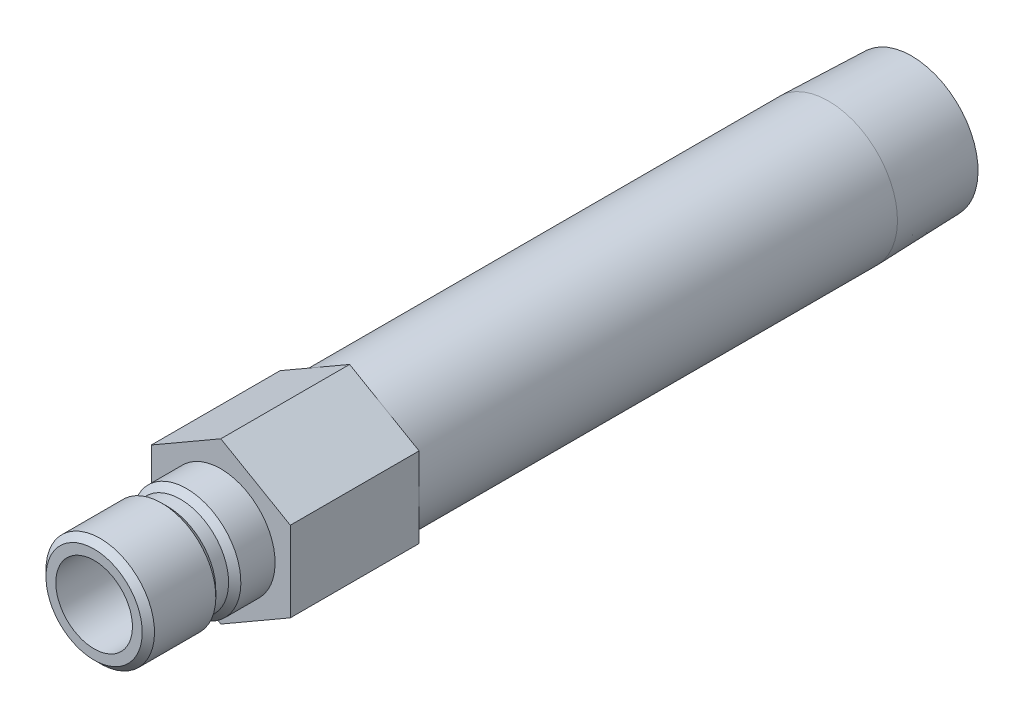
ISO-10303-21;
HEADER;
FILE_DESCRIPTION(('STEP AP214'),'2;1');
FILE_NAME('part.step','',(''),(''),'','','');
FILE_SCHEMA(('AUTOMOTIVE_DESIGN { 1 0 10303 214 1 1 1 1 }'));
ENDSEC;
DATA;
#1=APPLICATION_CONTEXT('core data for automotive mechanical design processes');
#2=APPLICATION_PROTOCOL_DEFINITION('international standard','automotive_design',2000,#1);
#3=PRODUCT_CONTEXT('',#1,'mechanical');
#4=PRODUCT('Part','Part','',(#3));
#5=PRODUCT_RELATED_PRODUCT_CATEGORY('part','',(#4));
#6=PRODUCT_DEFINITION_FORMATION('','',#4);
#7=PRODUCT_DEFINITION_CONTEXT('part definition',#1,'design');
#8=PRODUCT_DEFINITION('design','',#6,#7);
#9=PRODUCT_DEFINITION_SHAPE('','',#8);
#10=(LENGTH_UNIT() NAMED_UNIT(*) SI_UNIT(.MILLI.,.METRE.));
#11=(NAMED_UNIT(*) PLANE_ANGLE_UNIT() SI_UNIT($,.RADIAN.));
#12=(NAMED_UNIT(*) SI_UNIT($,.STERADIAN.) SOLID_ANGLE_UNIT());
#13=UNCERTAINTY_MEASURE_WITH_UNIT(LENGTH_MEASURE(1.E-05),#10,'distance_accuracy_value','');
#14=(GEOMETRIC_REPRESENTATION_CONTEXT(3) GLOBAL_UNCERTAINTY_ASSIGNED_CONTEXT((#13)) GLOBAL_UNIT_ASSIGNED_CONTEXT((#10,
#11,#12)) REPRESENTATION_CONTEXT('',''));
#15=CARTESIAN_POINT('',(0.,0.,0.));
#16=DIRECTION('',(0.,0.,1.));
#17=DIRECTION('',(1.,0.,0.));
#18=AXIS2_PLACEMENT_3D('',#15,#16,#17);
#19=CARTESIAN_POINT('',(0.,0.,0.));
#20=DIRECTION('',(0.,0.,-1.));
#21=DIRECTION('',(0.,1.,0.));
#22=AXIS2_PLACEMENT_3D('',#19,#20,#21);
#23=CYLINDRICAL_SURFACE('',#22,8.57249999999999);
#24=CARTESIAN_POINT('',(0.,0.,-75.5142));
#25=DIRECTION('',(0.,0.,-1.));
#26=DIRECTION('',(0.,1.,0.));
#27=AXIS2_PLACEMENT_3D('',#24,#25,#26);
#28=CIRCLE('',#27,8.57249999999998);
#29=CARTESIAN_POINT('',(0.,8.5725,-75.5142));
#30=VERTEX_POINT('',#29);
#31=EDGE_CURVE('E168',#30,#30,#28,.T.);
#32=ORIENTED_EDGE('',*,*,#31,.F.);
#33=EDGE_LOOP('',(#32));
#34=FACE_BOUND('',#33,.T.);
#35=CARTESIAN_POINT('',(0.,0.,-16.002));
#36=DIRECTION('',(0.,0.,1.));
#37=DIRECTION('',(1.,0.,0.));
#38=AXIS2_PLACEMENT_3D('',#35,#36,#37);
#39=CIRCLE('',#38,8.57249999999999);
#40=CARTESIAN_POINT('',(8.57249999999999,0.,-16.002));
#41=VERTEX_POINT('',#40);
#42=EDGE_CURVE('E37',#41,#41,#39,.F.);
#43=ORIENTED_EDGE('',*,*,#42,.T.);
#44=EDGE_LOOP('',(#43));
#45=FACE_BOUND('',#44,.T.);
#46=ADVANCED_FACE('F33',(#34,#45),#23,.T.);
#47=CARTESIAN_POINT('',(0.,0.,0.));
#48=DIRECTION('',(0.,0.,-1.));
#49=DIRECTION('',(0.,1.,0.));
#50=AXIS2_PLACEMENT_3D('',#47,#48,#49);
#51=CYLINDRICAL_SURFACE('',#50,4.7625);
#52=CARTESIAN_POINT('',(0.,0.,15.748));
#53=DIRECTION('',(0.,0.,-1.));
#54=DIRECTION('',(0.,1.,0.));
#55=AXIS2_PLACEMENT_3D('',#52,#53,#54);
#56=CIRCLE('',#55,4.7625);
#57=CARTESIAN_POINT('',(0.,4.7625,15.748));
#58=VERTEX_POINT('',#57);
#59=EDGE_CURVE('E144',#58,#58,#56,.T.);
#60=ORIENTED_EDGE('',*,*,#59,.F.);
#61=EDGE_LOOP('',(#60));
#62=FACE_BOUND('',#61,.T.);
#63=CARTESIAN_POINT('',(0.,0.,-16.002));
#64=DIRECTION('',(0.,0.,-1.));
#65=DIRECTION('',(0.,1.,0.));
#66=AXIS2_PLACEMENT_3D('',#63,#64,#65);
#67=CIRCLE('',#66,4.76249999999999);
#68=CARTESIAN_POINT('',(0.,4.7625,-16.002));
#69=VERTEX_POINT('',#68);
#70=EDGE_CURVE('E11',#69,#69,#67,.T.);
#71=ORIENTED_EDGE('',*,*,#70,.T.);
#72=EDGE_LOOP('',(#71));
#73=FACE_BOUND('',#72,.T.);
#74=ADVANCED_FACE('F35',(#62,#73),#51,.F.);
#75=CARTESIAN_POINT('',(0.,4.7625,-16.002));
#76=DIRECTION('',(0.,0.,-1.));
#77=DIRECTION('',(0.,1.,0.));
#78=AXIS2_PLACEMENT_3D('',#75,#76,#77);
#79=PLANE('',#78);
#80=CARTESIAN_POINT('',(0.,0.,-16.002));
#81=DIRECTION('',(0.,0.,-1.));
#82=DIRECTION('',(0.,1.,0.));
#83=AXIS2_PLACEMENT_3D('',#80,#81,#82);
#84=CIRCLE('',#83,6.26109999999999);
#85=CARTESIAN_POINT('',(0.,6.2611,-16.002));
#86=VERTEX_POINT('',#85);
#87=EDGE_CURVE('E43',#86,#86,#84,.T.);
#88=ORIENTED_EDGE('',*,*,#87,.T.);
#89=EDGE_LOOP('',(#88));
#90=FACE_BOUND('',#89,.T.);
#91=ORIENTED_EDGE('',*,*,#70,.F.);
#92=EDGE_LOOP('',(#91));
#93=FACE_BOUND('',#92,.T.);
#94=ADVANCED_FACE('F180',(#90,#93),#79,.T.);
#95=CARTESIAN_POINT('',(0.,0.,0.));
#96=DIRECTION('',(0.,0.,-1.));
#97=DIRECTION('',(0.,1.,0.));
#98=AXIS2_PLACEMENT_3D('',#95,#96,#97);
#99=CYLINDRICAL_SURFACE('',#98,6.26109999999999);
#100=CARTESIAN_POINT('',(0.,0.,-85.852));
#101=DIRECTION('',(0.,0.,-1.));
#102=DIRECTION('',(0.,1.,0.));
#103=AXIS2_PLACEMENT_3D('',#100,#101,#102);
#104=CIRCLE('',#103,6.26109999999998);
#105=CARTESIAN_POINT('',(0.,6.2611,-85.852));
#106=VERTEX_POINT('',#105);
#107=EDGE_CURVE('E174',#106,#106,#104,.T.);
#108=ORIENTED_EDGE('',*,*,#107,.T.);
#109=EDGE_LOOP('',(#108));
#110=FACE_BOUND('',#109,.T.);
#111=ORIENTED_EDGE('',*,*,#87,.F.);
#112=EDGE_LOOP('',(#111));
#113=FACE_BOUND('',#112,.T.);
#114=ADVANCED_FACE('F183',(#110,#113),#99,.F.);
#115=CARTESIAN_POINT('',(0.,8.24944566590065,-85.852));
#116=DIRECTION('',(0.,0.,-1.));
#117=DIRECTION('',(0.,1.,0.));
#118=AXIS2_PLACEMENT_3D('',#115,#116,#117);
#119=PLANE('',#118);
#120=CARTESIAN_POINT('',(0.,0.,-85.852));
#121=DIRECTION('',(0.,0.,-1.));
#122=DIRECTION('',(0.,1.,0.));
#123=AXIS2_PLACEMENT_3D('',#120,#121,#122);
#124=CIRCLE('',#123,8.24944566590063);
#125=CARTESIAN_POINT('',(0.,8.24944566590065,-85.852));
#126=VERTEX_POINT('',#125);
#127=EDGE_CURVE('E171',#126,#126,#124,.T.);
#128=ORIENTED_EDGE('',*,*,#127,.T.);
#129=EDGE_LOOP('',(#128));
#130=FACE_BOUND('',#129,.T.);
#131=ORIENTED_EDGE('',*,*,#107,.F.);
#132=EDGE_LOOP('',(#131));
#133=FACE_BOUND('',#132,.T.);
#134=ADVANCED_FACE('F185',(#130,#133),#119,.T.);
#135=CARTESIAN_POINT('',(0.,0.,-85.852));
#136=DIRECTION('',(0.,0.,1.));
#137=DIRECTION('',(0.,-1.,0.));
#138=AXIS2_PLACEMENT_3D('',#135,#136,#137);
#139=CONICAL_SURFACE('',#138,8.24944566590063,0.0312396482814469);
#140=ORIENTED_EDGE('',*,*,#31,.T.);
#141=EDGE_LOOP('',(#140));
#142=FACE_BOUND('',#141,.T.);
#143=ORIENTED_EDGE('',*,*,#127,.F.);
#144=EDGE_LOOP('',(#143));
#145=FACE_BOUND('',#144,.T.);
#146=ADVANCED_FACE('F192',(#142,#145),#139,.T.);
#147=CARTESIAN_POINT('',(0.,6.7437,0.));
#148=DIRECTION('',(0.,0.,1.));
#149=DIRECTION('',(0.,-1.,0.));
#150=AXIS2_PLACEMENT_3D('',#147,#148,#149);
#151=PLANE('',#150);
#152=CARTESIAN_POINT('',(0.,0.,0.));
#153=DIRECTION('',(0.,0.,-1.));
#154=DIRECTION('',(0.,1.,0.));
#155=AXIS2_PLACEMENT_3D('',#152,#153,#154);
#156=CIRCLE('',#155,6.7437);
#157=CARTESIAN_POINT('',(0.,6.7437,0.));
#158=VERTEX_POINT('',#157);
#159=EDGE_CURVE('E165',#158,#158,#156,.T.);
#160=ORIENTED_EDGE('',*,*,#159,.T.);
#161=EDGE_LOOP('',(#160));
#162=FACE_BOUND('',#161,.T.);
#163=DIRECTION('',(-0.866025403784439,-0.5,0.));
#164=VECTOR('',#163,1.);
#165=CARTESIAN_POINT('',(0.,9.97199384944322,0.));
#166=LINE('',#165,#164);
#167=CARTESIAN_POINT('',(0.,9.97199384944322,0.));
#168=VERTEX_POINT('',#167);
#169=CARTESIAN_POINT('',(-8.636,4.98599692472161,0.));
#170=VERTEX_POINT('',#169);
#171=EDGE_CURVE('E122',#168,#170,#166,.T.);
#172=ORIENTED_EDGE('',*,*,#171,.T.);
#173=DIRECTION('',(0.,-1.,0.));
#174=VECTOR('',#173,1.);
#175=CARTESIAN_POINT('',(-8.636,4.98599692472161,0.));
#176=LINE('',#175,#174);
#177=CARTESIAN_POINT('',(-8.636,-4.98599692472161,0.));
#178=VERTEX_POINT('',#177);
#179=EDGE_CURVE('E125',#170,#178,#176,.T.);
#180=ORIENTED_EDGE('',*,*,#179,.T.);
#181=DIRECTION('',(0.866025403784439,-0.5,0.));
#182=VECTOR('',#181,1.);
#183=CARTESIAN_POINT('',(-8.636,-4.98599692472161,0.));
#184=LINE('',#183,#182);
#185=CARTESIAN_POINT('',(0.,-9.97199384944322,0.));
#186=VERTEX_POINT('',#185);
#187=EDGE_CURVE('E128',#178,#186,#184,.T.);
#188=ORIENTED_EDGE('',*,*,#187,.T.);
#189=DIRECTION('',(0.866025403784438,0.5,0.));
#190=VECTOR('',#189,1.);
#191=CARTESIAN_POINT('',(0.,-9.97199384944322,0.));
#192=LINE('',#191,#190);
#193=CARTESIAN_POINT('',(8.63599999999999,-4.98599692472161,0.));
#194=VERTEX_POINT('',#193);
#195=EDGE_CURVE('E131',#186,#194,#192,.T.);
#196=ORIENTED_EDGE('',*,*,#195,.T.);
#197=DIRECTION('',(0.,1.,0.));
#198=VECTOR('',#197,1.);
#199=CARTESIAN_POINT('',(8.63599999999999,-4.98599692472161,0.));
#200=LINE('',#199,#198);
#201=CARTESIAN_POINT('',(8.636,4.98599692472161,0.));
#202=VERTEX_POINT('',#201);
#203=EDGE_CURVE('E99',#194,#202,#200,.T.);
#204=ORIENTED_EDGE('',*,*,#203,.T.);
#205=DIRECTION('',(-0.866025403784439,0.5,0.));
#206=VECTOR('',#205,1.);
#207=CARTESIAN_POINT('',(8.636,4.98599692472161,0.));
#208=LINE('',#207,#206);
#209=EDGE_CURVE('E134',#202,#168,#208,.T.);
#210=ORIENTED_EDGE('',*,*,#209,.T.);
#211=EDGE_LOOP('',(#172,#180,#188,#196,#204,#210));
#212=FACE_BOUND('',#211,.T.);
#213=ADVANCED_FACE('F206',(#162,#212),#151,.T.);
#214=CARTESIAN_POINT('',(0.,0.,0.));
#215=DIRECTION('',(0.,0.,-1.));
#216=DIRECTION('',(0.,1.,0.));
#217=AXIS2_PLACEMENT_3D('',#214,#215,#216);
#218=CYLINDRICAL_SURFACE('',#217,6.7437);
#219=CARTESIAN_POINT('',(0.,0.,4.25449999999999));
#220=DIRECTION('',(0.,0.,-1.));
#221=DIRECTION('',(0.,1.,0.));
#222=AXIS2_PLACEMENT_3D('',#219,#220,#221);
#223=CIRCLE('',#222,6.7437);
#224=CARTESIAN_POINT('',(0.,6.7437,4.2545));
#225=VERTEX_POINT('',#224);
#226=EDGE_CURVE('E162',#225,#225,#223,.T.);
#227=ORIENTED_EDGE('',*,*,#226,.T.);
#228=EDGE_LOOP('',(#227));
#229=FACE_BOUND('',#228,.T.);
#230=ORIENTED_EDGE('',*,*,#159,.F.);
#231=EDGE_LOOP('',(#230));
#232=FACE_BOUND('',#231,.T.);
#233=ADVANCED_FACE('F213',(#229,#232),#218,.T.);
#234=CARTESIAN_POINT('',(0.,0.,4.25449999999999));
#235=DIRECTION('',(0.,0.,-1.));
#236=DIRECTION('',(0.,1.,0.));
#237=AXIS2_PLACEMENT_3D('',#234,#235,#236);
#238=CONICAL_SURFACE('',#237,6.7437,0.785398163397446);
#239=CARTESIAN_POINT('',(0.,0.,5.0165));
#240=DIRECTION('',(0.,0.,-1.));
#241=DIRECTION('',(0.,1.,0.));
#242=AXIS2_PLACEMENT_3D('',#239,#240,#241);
#243=CIRCLE('',#242,5.9817);
#244=CARTESIAN_POINT('',(0.,5.9817,5.0165));
#245=VERTEX_POINT('',#244);
#246=EDGE_CURVE('E159',#245,#245,#243,.T.);
#247=ORIENTED_EDGE('',*,*,#246,.T.);
#248=EDGE_LOOP('',(#247));
#249=FACE_BOUND('',#248,.T.);
#250=ORIENTED_EDGE('',*,*,#226,.F.);
#251=EDGE_LOOP('',(#250));
#252=FACE_BOUND('',#251,.T.);
#253=ADVANCED_FACE('F222',(#249,#252),#238,.T.);
#254=CARTESIAN_POINT('',(0.,0.,0.));
#255=DIRECTION('',(0.,0.,-1.));
#256=DIRECTION('',(0.,1.,0.));
#257=AXIS2_PLACEMENT_3D('',#254,#255,#256);
#258=CYLINDRICAL_SURFACE('',#257,5.9817);
#259=CARTESIAN_POINT('',(0.,0.,6.604));
#260=DIRECTION('',(0.,0.,-1.));
#261=DIRECTION('',(0.,1.,0.));
#262=AXIS2_PLACEMENT_3D('',#259,#260,#261);
#263=CIRCLE('',#262,5.9817);
#264=CARTESIAN_POINT('',(0.,5.9817,6.604));
#265=VERTEX_POINT('',#264);
#266=EDGE_CURVE('E156',#265,#265,#263,.T.);
#267=ORIENTED_EDGE('',*,*,#266,.T.);
#268=EDGE_LOOP('',(#267));
#269=FACE_BOUND('',#268,.T.);
#270=ORIENTED_EDGE('',*,*,#246,.F.);
#271=EDGE_LOOP('',(#270));
#272=FACE_BOUND('',#271,.T.);
#273=ADVANCED_FACE('F263',(#269,#272),#258,.T.);
#274=CARTESIAN_POINT('',(0.,0.,6.604));
#275=DIRECTION('',(0.,0.,1.));
#276=DIRECTION('',(0.,-1.,0.));
#277=AXIS2_PLACEMENT_3D('',#274,#275,#276);
#278=CONICAL_SURFACE('',#277,5.9817,0.785398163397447);
#279=CARTESIAN_POINT('',(0.,0.,7.366));
#280=DIRECTION('',(0.,0.,-1.));
#281=DIRECTION('',(0.,1.,0.));
#282=AXIS2_PLACEMENT_3D('',#279,#280,#281);
#283=CIRCLE('',#282,6.7437);
#284=CARTESIAN_POINT('',(0.,6.7437,7.366));
#285=VERTEX_POINT('',#284);
#286=EDGE_CURVE('E153',#285,#285,#283,.T.);
#287=ORIENTED_EDGE('',*,*,#286,.T.);
#288=EDGE_LOOP('',(#287));
#289=FACE_BOUND('',#288,.T.);
#290=ORIENTED_EDGE('',*,*,#266,.F.);
#291=EDGE_LOOP('',(#290));
#292=FACE_BOUND('',#291,.T.);
#293=ADVANCED_FACE('F259',(#289,#292),#278,.T.);
#294=CARTESIAN_POINT('',(0.,0.,0.));
#295=DIRECTION('',(0.,0.,-1.));
#296=DIRECTION('',(0.,1.,0.));
#297=AXIS2_PLACEMENT_3D('',#294,#295,#296);
#298=CYLINDRICAL_SURFACE('',#297,6.7437);
#299=CARTESIAN_POINT('',(0.,0.,14.986));
#300=DIRECTION('',(0.,0.,-1.));
#301=DIRECTION('',(0.,1.,0.));
#302=AXIS2_PLACEMENT_3D('',#299,#300,#301);
#303=CIRCLE('',#302,6.7437);
#304=CARTESIAN_POINT('',(0.,6.7437,14.986));
#305=VERTEX_POINT('',#304);
#306=EDGE_CURVE('E150',#305,#305,#303,.T.);
#307=ORIENTED_EDGE('',*,*,#306,.T.);
#308=EDGE_LOOP('',(#307));
#309=FACE_BOUND('',#308,.T.);
#310=ORIENTED_EDGE('',*,*,#286,.F.);
#311=EDGE_LOOP('',(#310));
#312=FACE_BOUND('',#311,.T.);
#313=ADVANCED_FACE('F255',(#309,#312),#298,.T.);
#314=CARTESIAN_POINT('',(0.,0.,14.986));
#315=DIRECTION('',(0.,0.,-1.));
#316=DIRECTION('',(0.,1.,0.));
#317=AXIS2_PLACEMENT_3D('',#314,#315,#316);
#318=CONICAL_SURFACE('',#317,6.7437,0.785398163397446);
#319=CARTESIAN_POINT('',(0.,0.,15.748));
#320=DIRECTION('',(0.,0.,-1.));
#321=DIRECTION('',(0.,1.,0.));
#322=AXIS2_PLACEMENT_3D('',#319,#320,#321);
#323=CIRCLE('',#322,5.9817);
#324=CARTESIAN_POINT('',(0.,5.9817,15.748));
#325=VERTEX_POINT('',#324);
#326=EDGE_CURVE('E147',#325,#325,#323,.T.);
#327=ORIENTED_EDGE('',*,*,#326,.T.);
#328=EDGE_LOOP('',(#327));
#329=FACE_BOUND('',#328,.T.);
#330=ORIENTED_EDGE('',*,*,#306,.F.);
#331=EDGE_LOOP('',(#330));
#332=FACE_BOUND('',#331,.T.);
#333=ADVANCED_FACE('F251',(#329,#332),#318,.T.);
#334=CARTESIAN_POINT('',(0.,4.7625,15.748));
#335=DIRECTION('',(0.,0.,1.));
#336=DIRECTION('',(0.,-1.,0.));
#337=AXIS2_PLACEMENT_3D('',#334,#335,#336);
#338=PLANE('',#337);
#339=ORIENTED_EDGE('',*,*,#59,.T.);
#340=EDGE_LOOP('',(#339));
#341=FACE_BOUND('',#340,.T.);
#342=ORIENTED_EDGE('',*,*,#326,.F.);
#343=EDGE_LOOP('',(#342));
#344=FACE_BOUND('',#343,.T.);
#345=ADVANCED_FACE('F239',(#341,#344),#338,.T.);
#346=CARTESIAN_POINT('',(0.,9.97199384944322,-16.002));
#347=DIRECTION('',(-0.5,0.866025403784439,0.));
#348=DIRECTION('',(-0.866025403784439,-0.5,0.));
#349=AXIS2_PLACEMENT_3D('',#346,#347,#348);
#350=PLANE('',#349);
#351=ORIENTED_EDGE('',*,*,#171,.F.);
#352=DIRECTION('',(0.,0.,1.));
#353=VECTOR('',#352,1.);
#354=CARTESIAN_POINT('',(0.,9.97199384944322,-16.002));
#355=LINE('',#354,#353);
#356=CARTESIAN_POINT('',(0.,9.97199384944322,-16.002));
#357=VERTEX_POINT('',#356);
#358=EDGE_CURVE('E51',#357,#168,#355,.T.);
#359=ORIENTED_EDGE('',*,*,#358,.F.);
#360=DIRECTION('',(-0.866025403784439,-0.5,0.));
#361=VECTOR('',#360,1.);
#362=CARTESIAN_POINT('',(0.,9.97199384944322,-16.002));
#363=LINE('',#362,#361);
#364=CARTESIAN_POINT('',(-8.636,4.98599692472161,-16.002));
#365=VERTEX_POINT('',#364);
#366=EDGE_CURVE('E137',#357,#365,#363,.T.);
#367=ORIENTED_EDGE('',*,*,#366,.T.);
#368=DIRECTION('',(0.,0.,1.));
#369=VECTOR('',#368,1.);
#370=CARTESIAN_POINT('',(-8.636,4.98599692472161,-16.002));
#371=LINE('',#370,#369);
#372=EDGE_CURVE('E86',#365,#170,#371,.T.);
#373=ORIENTED_EDGE('',*,*,#372,.T.);
#374=EDGE_LOOP('',(#351,#359,#367,#373));
#375=FACE_BOUND('',#374,.T.);
#376=ADVANCED_FACE('F226',(#375),#350,.T.);
#377=CARTESIAN_POINT('',(8.636,4.98599692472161,-16.002));
#378=DIRECTION('',(0.5,0.866025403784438,0.));
#379=DIRECTION('',(-0.866025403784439,0.5,0.));
#380=AXIS2_PLACEMENT_3D('',#377,#378,#379);
#381=PLANE('',#380);
#382=ORIENTED_EDGE('',*,*,#209,.F.);
#383=DIRECTION('',(0.,0.,1.));
#384=VECTOR('',#383,1.);
#385=CARTESIAN_POINT('',(8.636,4.98599692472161,-16.002));
#386=LINE('',#385,#384);
#387=CARTESIAN_POINT('',(8.636,4.98599692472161,-16.002));
#388=VERTEX_POINT('',#387);
#389=EDGE_CURVE('E74',#388,#202,#386,.T.);
#390=ORIENTED_EDGE('',*,*,#389,.F.);
#391=DIRECTION('',(-0.866025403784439,0.5,0.));
#392=VECTOR('',#391,1.);
#393=CARTESIAN_POINT('',(8.636,4.98599692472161,-16.002));
#394=LINE('',#393,#392);
#395=EDGE_CURVE('E112',#388,#357,#394,.T.);
#396=ORIENTED_EDGE('',*,*,#395,.T.);
#397=ORIENTED_EDGE('',*,*,#358,.T.);
#398=EDGE_LOOP('',(#382,#390,#396,#397));
#399=FACE_BOUND('',#398,.T.);
#400=ADVANCED_FACE('F231',(#399),#381,.T.);
#401=CARTESIAN_POINT('',(8.63599999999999,-4.98599692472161,-16.002));
#402=DIRECTION('',(1.,0.,0.));
#403=DIRECTION('',(0.,1.,0.));
#404=AXIS2_PLACEMENT_3D('',#401,#402,#403);
#405=PLANE('',#404);
#406=ORIENTED_EDGE('',*,*,#203,.F.);
#407=DIRECTION('',(0.,0.,1.));
#408=VECTOR('',#407,1.);
#409=CARTESIAN_POINT('',(8.63599999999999,-4.98599692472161,-16.002));
#410=LINE('',#409,#408);
#411=CARTESIAN_POINT('',(8.63599999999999,-4.98599692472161,-16.002));
#412=VERTEX_POINT('',#411);
#413=EDGE_CURVE('E94',#412,#194,#410,.T.);
#414=ORIENTED_EDGE('',*,*,#413,.F.);
#415=DIRECTION('',(0.,1.,0.));
#416=VECTOR('',#415,1.);
#417=CARTESIAN_POINT('',(8.63599999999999,-4.98599692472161,-16.002));
#418=LINE('',#417,#416);
#419=EDGE_CURVE('E97',#412,#388,#418,.T.);
#420=ORIENTED_EDGE('',*,*,#419,.T.);
#421=ORIENTED_EDGE('',*,*,#389,.T.);
#422=EDGE_LOOP('',(#406,#414,#420,#421));
#423=FACE_BOUND('',#422,.T.);
#424=ADVANCED_FACE('F96',(#423),#405,.T.);
#425=CARTESIAN_POINT('',(0.,-9.97199384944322,-16.002));
#426=DIRECTION('',(0.5,-0.866025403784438,0.));
#427=DIRECTION('',(0.866025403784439,0.5,0.));
#428=AXIS2_PLACEMENT_3D('',#425,#426,#427);
#429=PLANE('',#428);
#430=ORIENTED_EDGE('',*,*,#195,.F.);
#431=DIRECTION('',(0.,0.,1.));
#432=VECTOR('',#431,1.);
#433=CARTESIAN_POINT('',(0.,-9.97199384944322,-16.002));
#434=LINE('',#433,#432);
#435=CARTESIAN_POINT('',(0.,-9.97199384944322,-16.002));
#436=VERTEX_POINT('',#435);
#437=EDGE_CURVE('E104',#436,#186,#434,.T.);
#438=ORIENTED_EDGE('',*,*,#437,.F.);
#439=DIRECTION('',(0.866025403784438,0.5,0.));
#440=VECTOR('',#439,1.);
#441=CARTESIAN_POINT('',(0.,-9.97199384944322,-16.002));
#442=LINE('',#441,#440);
#443=EDGE_CURVE('E110',#436,#412,#442,.T.);
#444=ORIENTED_EDGE('',*,*,#443,.T.);
#445=ORIENTED_EDGE('',*,*,#413,.T.);
#446=EDGE_LOOP('',(#430,#438,#444,#445));
#447=FACE_BOUND('',#446,.T.);
#448=ADVANCED_FACE('F114',(#447),#429,.T.);
#449=CARTESIAN_POINT('',(-8.636,-4.98599692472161,-16.002));
#450=DIRECTION('',(-0.5,-0.866025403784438,0.));
#451=DIRECTION('',(0.866025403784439,-0.5,0.));
#452=AXIS2_PLACEMENT_3D('',#449,#450,#451);
#453=PLANE('',#452);
#454=ORIENTED_EDGE('',*,*,#187,.F.);
#455=DIRECTION('',(0.,0.,1.));
#456=VECTOR('',#455,1.);
#457=CARTESIAN_POINT('',(-8.636,-4.98599692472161,-16.002));
#458=LINE('',#457,#456);
#459=CARTESIAN_POINT('',(-8.636,-4.98599692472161,-16.002));
#460=VERTEX_POINT('',#459);
#461=EDGE_CURVE('E141',#460,#178,#458,.T.);
#462=ORIENTED_EDGE('',*,*,#461,.F.);
#463=DIRECTION('',(0.866025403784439,-0.5,0.));
#464=VECTOR('',#463,1.);
#465=CARTESIAN_POINT('',(-8.636,-4.98599692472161,-16.002));
#466=LINE('',#465,#464);
#467=EDGE_CURVE('E115',#460,#436,#466,.T.);
#468=ORIENTED_EDGE('',*,*,#467,.T.);
#469=ORIENTED_EDGE('',*,*,#437,.T.);
#470=EDGE_LOOP('',(#454,#462,#468,#469));
#471=FACE_BOUND('',#470,.T.);
#472=ADVANCED_FACE('F230',(#471),#453,.T.);
#473=CARTESIAN_POINT('',(-8.636,4.98599692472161,-16.002));
#474=DIRECTION('',(-1.,0.,0.));
#475=DIRECTION('',(0.,0.,1.));
#476=AXIS2_PLACEMENT_3D('',#473,#474,#475);
#477=PLANE('',#476);
#478=ORIENTED_EDGE('',*,*,#179,.F.);
#479=ORIENTED_EDGE('',*,*,#372,.F.);
#480=DIRECTION('',(0.,-1.,0.));
#481=VECTOR('',#480,1.);
#482=CARTESIAN_POINT('',(-8.636,4.98599692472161,-16.002));
#483=LINE('',#482,#481);
#484=EDGE_CURVE('E117',#365,#460,#483,.T.);
#485=ORIENTED_EDGE('',*,*,#484,.T.);
#486=ORIENTED_EDGE('',*,*,#461,.T.);
#487=EDGE_LOOP('',(#478,#479,#485,#486));
#488=FACE_BOUND('',#487,.T.);
#489=ADVANCED_FACE('F227',(#488),#477,.T.);
#490=CARTESIAN_POINT('',(-8.636,4.98599692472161,-16.002));
#491=DIRECTION('',(0.,0.,1.));
#492=DIRECTION('',(1.,0.,0.));
#493=AXIS2_PLACEMENT_3D('',#490,#491,#492);
#494=PLANE('',#493);
#495=ORIENTED_EDGE('',*,*,#42,.F.);
#496=EDGE_LOOP('',(#495));
#497=FACE_BOUND('',#496,.T.);
#498=ORIENTED_EDGE('',*,*,#366,.F.);
#499=ORIENTED_EDGE('',*,*,#395,.F.);
#500=ORIENTED_EDGE('',*,*,#419,.F.);
#501=ORIENTED_EDGE('',*,*,#443,.F.);
#502=ORIENTED_EDGE('',*,*,#467,.F.);
#503=ORIENTED_EDGE('',*,*,#484,.F.);
#504=EDGE_LOOP('',(#498,#499,#500,#501,#502,#503));
#505=FACE_BOUND('',#504,.T.);
#506=ADVANCED_FACE('F108',(#497,#505),#494,.F.);
#507=CLOSED_SHELL('',(#46,#74,#94,#114,#134,#146,#213,#233,#253,#273,#293,#313,#333,#345,#376,
#400,#424,#448,#472,#489,#506));
#508=MANIFOLD_SOLID_BREP('B2',#507);
#509=ADVANCED_BREP_SHAPE_REPRESENTATION('',(#18,#508),#14);
#510=SHAPE_DEFINITION_REPRESENTATION(#9,#509);
ENDSEC;
END-ISO-10303-21;
